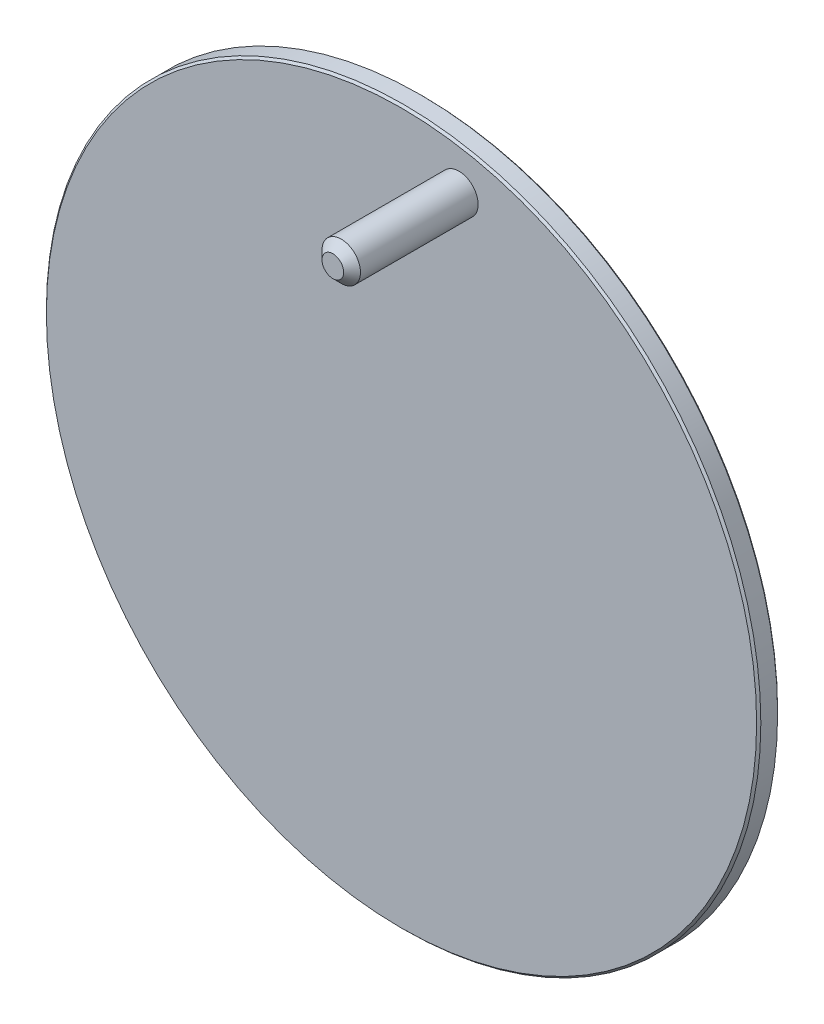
ISO-10303-21;
HEADER;
FILE_DESCRIPTION(('STEP AP214'),'2;1');
FILE_NAME('part.step','',(''),(''),'','','');
FILE_SCHEMA(('AUTOMOTIVE_DESIGN { 1 0 10303 214 1 1 1 1 }'));
ENDSEC;
DATA;
#1=APPLICATION_CONTEXT('core data for automotive mechanical design processes');
#2=APPLICATION_PROTOCOL_DEFINITION('international standard','automotive_design',2000,#1);
#3=PRODUCT_CONTEXT('',#1,'mechanical');
#4=PRODUCT('Part','Part','',(#3));
#5=PRODUCT_RELATED_PRODUCT_CATEGORY('part','',(#4));
#6=PRODUCT_DEFINITION_FORMATION('','',#4);
#7=PRODUCT_DEFINITION_CONTEXT('part definition',#1,'design');
#8=PRODUCT_DEFINITION('design','',#6,#7);
#9=PRODUCT_DEFINITION_SHAPE('','',#8);
#10=(LENGTH_UNIT() NAMED_UNIT(*) SI_UNIT(.MILLI.,.METRE.));
#11=(NAMED_UNIT(*) PLANE_ANGLE_UNIT() SI_UNIT($,.RADIAN.));
#12=(NAMED_UNIT(*) SI_UNIT($,.STERADIAN.) SOLID_ANGLE_UNIT());
#13=UNCERTAINTY_MEASURE_WITH_UNIT(LENGTH_MEASURE(1.E-05),#10,'distance_accuracy_value','');
#14=(GEOMETRIC_REPRESENTATION_CONTEXT(3) GLOBAL_UNCERTAINTY_ASSIGNED_CONTEXT((#13)) GLOBAL_UNIT_ASSIGNED_CONTEXT((#10,
#11,#12)) REPRESENTATION_CONTEXT('',''));
#15=CARTESIAN_POINT('',(0.,0.,0.));
#16=DIRECTION('',(0.,0.,1.));
#17=DIRECTION('',(1.,0.,0.));
#18=AXIS2_PLACEMENT_3D('',#15,#16,#17);
#19=CARTESIAN_POINT('',(35.2319606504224,60.2768161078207,35.8999999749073));
#20=DIRECTION('',(0.,0.,1.));
#21=DIRECTION('',(-0.943674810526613,-0.330874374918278,0.));
#22=AXIS2_PLACEMENT_3D('',#19,#20,#21);
#23=PLANE('',#22);
#24=CARTESIAN_POINT('',(35.2319606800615,60.2768161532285,35.8999999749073));
#25=DIRECTION('',(0.,0.,1.));
#26=DIRECTION('',(0.,-1.,0.));
#27=AXIS2_PLACEMENT_3D('',#24,#25,#26);
#28=CIRCLE('',#27,84.5);
#29=CARTESIAN_POINT('',(35.2319606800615,-24.2231838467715,35.8999999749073));
#30=VERTEX_POINT('',#29);
#31=EDGE_CURVE('E47',#30,#30,#28,.T.);
#32=ORIENTED_EDGE('',*,*,#31,.T.);
#33=EDGE_LOOP('',(#32));
#34=FACE_BOUND('',#33,.T.);
#35=CARTESIAN_POINT('',(48.895655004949,134.021669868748,35.8999999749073));
#36=DIRECTION('',(0.,0.,1.));
#37=DIRECTION('',(1.,0.,0.));
#38=AXIS2_PLACEMENT_3D('',#35,#36,#37);
#39=CIRCLE('',#38,4.57379055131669);
#40=CARTESIAN_POINT('',(53.4694455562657,134.021669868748,35.8999999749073));
#41=VERTEX_POINT('',#40);
#42=EDGE_CURVE('E55',#41,#41,#39,.T.);
#43=ORIENTED_EDGE('',*,*,#42,.F.);
#44=EDGE_LOOP('',(#43));
#45=FACE_BOUND('',#44,.T.);
#46=ADVANCED_FACE('F24',(#34,#45),#23,.T.);
#47=CARTESIAN_POINT('',(35.2319606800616,60.2768161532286,78.3264068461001));
#48=DIRECTION('',(0.,0.,-1.));
#49=DIRECTION('',(-1.,0.,0.));
#50=AXIS2_PLACEMENT_3D('',#47,#48,#49);
#51=CYLINDRICAL_SURFACE('',#50,15.);
#52=CARTESIAN_POINT('',(35.2319606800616,60.2768161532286,0.));
#53=DIRECTION('',(0.,0.,1.));
#54=DIRECTION('',(1.,0.,0.));
#55=AXIS2_PLACEMENT_3D('',#52,#53,#54);
#56=CIRCLE('',#55,15.);
#57=CARTESIAN_POINT('',(50.2319606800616,60.2768161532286,0.));
#58=VERTEX_POINT('',#57);
#59=EDGE_CURVE('E56',#58,#58,#56,.T.);
#60=ORIENTED_EDGE('',*,*,#59,.T.);
#61=EDGE_LOOP('',(#60));
#62=FACE_BOUND('',#61,.T.);
#63=CARTESIAN_POINT('',(35.2319606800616,60.2768161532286,30.8999999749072));
#64=DIRECTION('',(0.,0.,1.));
#65=DIRECTION('',(1.,0.,0.));
#66=AXIS2_PLACEMENT_3D('',#63,#64,#65);
#67=CIRCLE('',#66,15.);
#68=CARTESIAN_POINT('',(50.2319606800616,60.2768161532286,30.8999999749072));
#69=VERTEX_POINT('',#68);
#70=EDGE_CURVE('E50',#69,#69,#67,.T.);
#71=ORIENTED_EDGE('',*,*,#70,.F.);
#72=EDGE_LOOP('',(#71));
#73=FACE_BOUND('',#72,.T.);
#74=ADVANCED_FACE('F26',(#62,#73),#51,.T.);
#75=CARTESIAN_POINT('',(35.2319606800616,60.2768161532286,78.3264068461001));
#76=DIRECTION('',(0.,0.,-1.));
#77=DIRECTION('',(-1.,0.,0.));
#78=AXIS2_PLACEMENT_3D('',#75,#76,#77);
#79=CYLINDRICAL_SURFACE('',#78,8.08065792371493);
#80=CARTESIAN_POINT('',(35.2319606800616,60.2768161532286,0.));
#81=DIRECTION('',(0.,0.,1.));
#82=DIRECTION('',(1.,0.,0.));
#83=AXIS2_PLACEMENT_3D('',#80,#81,#82);
#84=CIRCLE('',#83,8.08065792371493);
#85=CARTESIAN_POINT('',(43.3126186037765,60.2768161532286,0.));
#86=VERTEX_POINT('',#85);
#87=EDGE_CURVE('E54',#86,#86,#84,.T.);
#88=ORIENTED_EDGE('',*,*,#87,.F.);
#89=EDGE_LOOP('',(#88));
#90=FACE_BOUND('',#89,.T.);
#91=CARTESIAN_POINT('',(35.2319606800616,60.2768161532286,30.8999999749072));
#92=DIRECTION('',(0.,0.,1.));
#93=DIRECTION('',(1.,0.,0.));
#94=AXIS2_PLACEMENT_3D('',#91,#92,#93);
#95=CIRCLE('',#94,8.08065792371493);
#96=CARTESIAN_POINT('',(43.3126186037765,60.2768161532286,30.8999999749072));
#97=VERTEX_POINT('',#96);
#98=EDGE_CURVE('E51',#97,#97,#95,.T.);
#99=ORIENTED_EDGE('',*,*,#98,.T.);
#100=EDGE_LOOP('',(#99));
#101=FACE_BOUND('',#100,.T.);
#102=ADVANCED_FACE('F76',(#90,#101),#79,.F.);
#103=CARTESIAN_POINT('',(35.2319606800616,60.2768161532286,0.));
#104=DIRECTION('',(0.,0.,1.));
#105=DIRECTION('',(1.,0.,0.));
#106=AXIS2_PLACEMENT_3D('',#103,#104,#105);
#107=PLANE('',#106);
#108=ORIENTED_EDGE('',*,*,#59,.F.);
#109=EDGE_LOOP('',(#108));
#110=FACE_BOUND('',#109,.T.);
#111=ORIENTED_EDGE('',*,*,#87,.T.);
#112=EDGE_LOOP('',(#111));
#113=FACE_BOUND('',#112,.T.);
#114=ADVANCED_FACE('F83',(#110,#113),#107,.F.);
#115=CARTESIAN_POINT('',(35.2319606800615,60.2768161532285,30.8999999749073));
#116=DIRECTION('',(0.,0.,1.));
#117=DIRECTION('',(1.,0.,0.));
#118=AXIS2_PLACEMENT_3D('',#115,#116,#117);
#119=PLANE('',#118);
#120=ORIENTED_EDGE('',*,*,#98,.F.);
#121=EDGE_LOOP('',(#120));
#122=FACE_BOUND('',#121,.T.);
#123=ADVANCED_FACE('F86',(#122),#119,.F.);
#124=CARTESIAN_POINT('',(35.2319606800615,60.2768161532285,30.8999999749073));
#125=DIRECTION('',(0.,0.,1.));
#126=DIRECTION('',(1.,0.,0.));
#127=AXIS2_PLACEMENT_3D('',#124,#125,#126);
#128=CIRCLE('',#127,84.5);
#129=CARTESIAN_POINT('',(119.731960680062,60.2768161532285,30.8999999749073));
#130=VERTEX_POINT('',#129);
#131=EDGE_CURVE('E35',#130,#130,#128,.F.);
#132=ORIENTED_EDGE('',*,*,#131,.T.);
#133=EDGE_LOOP('',(#132));
#134=FACE_BOUND('',#133,.T.);
#135=ORIENTED_EDGE('',*,*,#70,.T.);
#136=EDGE_LOOP('',(#135));
#137=FACE_BOUND('',#136,.T.);
#138=ADVANCED_FACE('F90',(#134,#137),#119,.F.);
#139=CARTESIAN_POINT('',(35.2319606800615,60.2768161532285,30.8999999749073));
#140=DIRECTION('',(0.,0.,1.));
#141=DIRECTION('',(1.,0.,0.));
#142=AXIS2_PLACEMENT_3D('',#139,#140,#141);
#143=CYLINDRICAL_SURFACE('',#142,85.);
#144=CARTESIAN_POINT('',(35.2319606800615,60.2768161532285,35.3999999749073));
#145=DIRECTION('',(0.,0.,1.));
#146=DIRECTION('',(1.,0.,0.));
#147=AXIS2_PLACEMENT_3D('',#144,#145,#146);
#148=CIRCLE('',#147,85.);
#149=CARTESIAN_POINT('',(120.231960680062,60.2768161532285,35.3999999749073));
#150=VERTEX_POINT('',#149);
#151=EDGE_CURVE('E39',#150,#150,#148,.F.);
#152=ORIENTED_EDGE('',*,*,#151,.T.);
#153=EDGE_LOOP('',(#152));
#154=FACE_BOUND('',#153,.T.);
#155=CARTESIAN_POINT('',(35.2319606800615,60.2768161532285,31.3999999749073));
#156=DIRECTION('',(0.,0.,1.));
#157=DIRECTION('',(1.,0.,0.));
#158=AXIS2_PLACEMENT_3D('',#155,#156,#157);
#159=CIRCLE('',#158,85.);
#160=CARTESIAN_POINT('',(120.231960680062,60.2768161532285,31.3999999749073));
#161=VERTEX_POINT('',#160);
#162=EDGE_CURVE('E44',#161,#161,#159,.T.);
#163=ORIENTED_EDGE('',*,*,#162,.T.);
#164=EDGE_LOOP('',(#163));
#165=FACE_BOUND('',#164,.T.);
#166=ADVANCED_FACE('F80',(#154,#165),#143,.T.);
#167=CARTESIAN_POINT('',(48.895655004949,134.021669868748,65.8999999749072));
#168=DIRECTION('',(0.,0.,-1.));
#169=DIRECTION('',(-1.,0.,0.));
#170=AXIS2_PLACEMENT_3D('',#167,#168,#169);
#171=CYLINDRICAL_SURFACE('',#170,4.57379055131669);
#172=CARTESIAN_POINT('',(48.895655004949,134.021669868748,63.8999999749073));
#173=DIRECTION('',(0.,0.,1.));
#174=DIRECTION('',(1.,0.,0.));
#175=AXIS2_PLACEMENT_3D('',#172,#173,#174);
#176=CIRCLE('',#175,4.57379055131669);
#177=CARTESIAN_POINT('',(53.4694455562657,134.021669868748,63.8999999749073));
#178=VERTEX_POINT('',#177);
#179=EDGE_CURVE('E10',#178,#178,#176,.F.);
#180=ORIENTED_EDGE('',*,*,#179,.T.);
#181=EDGE_LOOP('',(#180));
#182=FACE_BOUND('',#181,.T.);
#183=ORIENTED_EDGE('',*,*,#42,.T.);
#184=EDGE_LOOP('',(#183));
#185=FACE_BOUND('',#184,.T.);
#186=ADVANCED_FACE('F66',(#182,#185),#171,.T.);
#187=CARTESIAN_POINT('',(48.895655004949,134.021669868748,65.8999999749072));
#188=DIRECTION('',(0.,0.,1.));
#189=DIRECTION('',(1.,0.,0.));
#190=AXIS2_PLACEMENT_3D('',#187,#188,#189);
#191=PLANE('',#190);
#192=CARTESIAN_POINT('',(48.895655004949,134.021669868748,65.8999999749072));
#193=DIRECTION('',(0.,0.,1.));
#194=DIRECTION('',(1.,0.,0.));
#195=AXIS2_PLACEMENT_3D('',#192,#193,#194);
#196=CIRCLE('',#195,2.57379055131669);
#197=CARTESIAN_POINT('',(51.4694455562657,134.021669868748,65.8999999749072));
#198=VERTEX_POINT('',#197);
#199=EDGE_CURVE('E31',#198,#198,#196,.T.);
#200=ORIENTED_EDGE('',*,*,#199,.T.);
#201=EDGE_LOOP('',(#200));
#202=FACE_BOUND('',#201,.T.);
#203=ADVANCED_FACE('F108',(#202),#191,.T.);
#204=CARTESIAN_POINT('',(35.2319606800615,60.2768161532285,35.8999999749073));
#205=DIRECTION('',(0.,0.,-1.));
#206=DIRECTION('',(-1.,0.,0.));
#207=AXIS2_PLACEMENT_3D('',#204,#205,#206);
#208=CONICAL_SURFACE('',#207,84.5,0.785398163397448);
#209=ORIENTED_EDGE('',*,*,#151,.F.);
#210=EDGE_LOOP('',(#209));
#211=FACE_BOUND('',#210,.T.);
#212=ORIENTED_EDGE('',*,*,#31,.F.);
#213=EDGE_LOOP('',(#212));
#214=FACE_BOUND('',#213,.T.);
#215=ADVANCED_FACE('F111',(#211,#214),#208,.T.);
#216=CARTESIAN_POINT('',(35.2319606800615,60.2768161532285,31.3999999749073));
#217=DIRECTION('',(0.,0.,1.));
#218=DIRECTION('',(1.,0.,0.));
#219=AXIS2_PLACEMENT_3D('',#216,#217,#218);
#220=CONICAL_SURFACE('',#219,85.,0.785398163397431);
#221=ORIENTED_EDGE('',*,*,#131,.F.);
#222=EDGE_LOOP('',(#221));
#223=FACE_BOUND('',#222,.T.);
#224=ORIENTED_EDGE('',*,*,#162,.F.);
#225=EDGE_LOOP('',(#224));
#226=FACE_BOUND('',#225,.T.);
#227=ADVANCED_FACE('F114',(#223,#226),#220,.T.);
#228=CARTESIAN_POINT('',(48.895655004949,134.021669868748,65.8999999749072));
#229=DIRECTION('',(0.,0.,-1.));
#230=DIRECTION('',(-1.,0.,0.));
#231=AXIS2_PLACEMENT_3D('',#228,#229,#230);
#232=CONICAL_SURFACE('',#231,2.57379055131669,0.785398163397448);
#233=ORIENTED_EDGE('',*,*,#179,.F.);
#234=EDGE_LOOP('',(#233));
#235=FACE_BOUND('',#234,.T.);
#236=ORIENTED_EDGE('',*,*,#199,.F.);
#237=EDGE_LOOP('',(#236));
#238=FACE_BOUND('',#237,.T.);
#239=ADVANCED_FACE('F118',(#235,#238),#232,.T.);
#240=CLOSED_SHELL('',(#46,#74,#102,#114,#123,#138,#166,#186,#203,#215,#227,#239));
#241=MANIFOLD_SOLID_BREP('B2',#240);
#242=ADVANCED_BREP_SHAPE_REPRESENTATION('',(#18,#241),#14);
#243=SHAPE_DEFINITION_REPRESENTATION(#9,#242);
ENDSEC;
END-ISO-10303-21;
